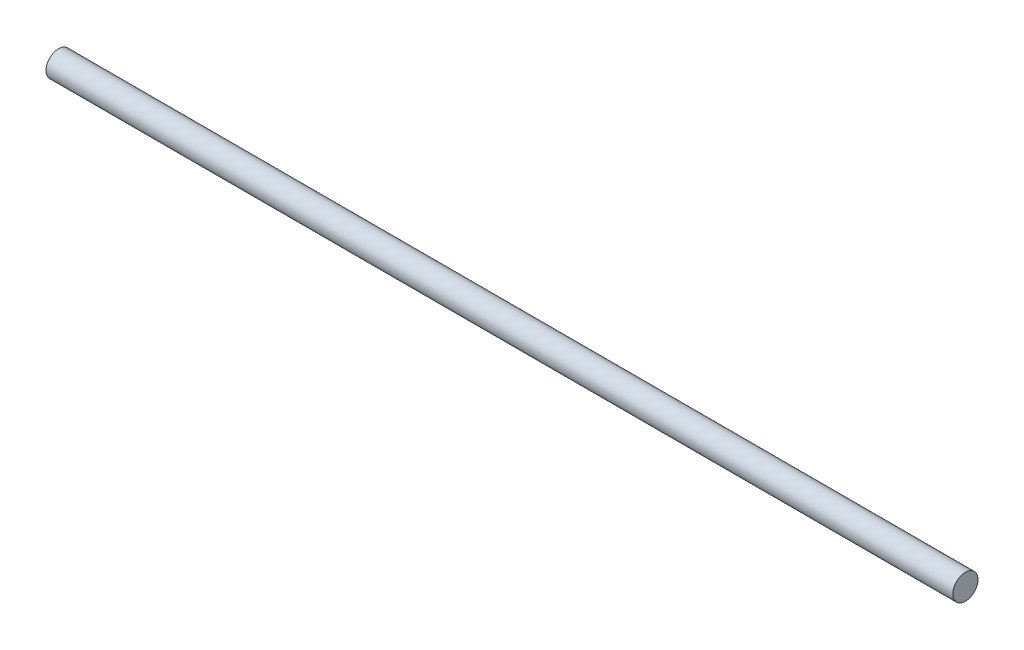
from build123d import *

# Parameters (mm, degrees)
SKETCH1_R           = 3.175
BOSS_EXTRUDE1_DEPTH = 114.3


with BuildPart() as part:
    # Sketch1 → Boss-Extrude1 (new, symmetric)
    with BuildSketch(Plane(origin=(0, 0, 0), x_dir=(0, 0, -1), z_dir=(1, 0, 0))):
        Circle(SKETCH1_R)
    extrude(amount=BOSS_EXTRUDE1_DEPTH, both=True)


solid = part.part
